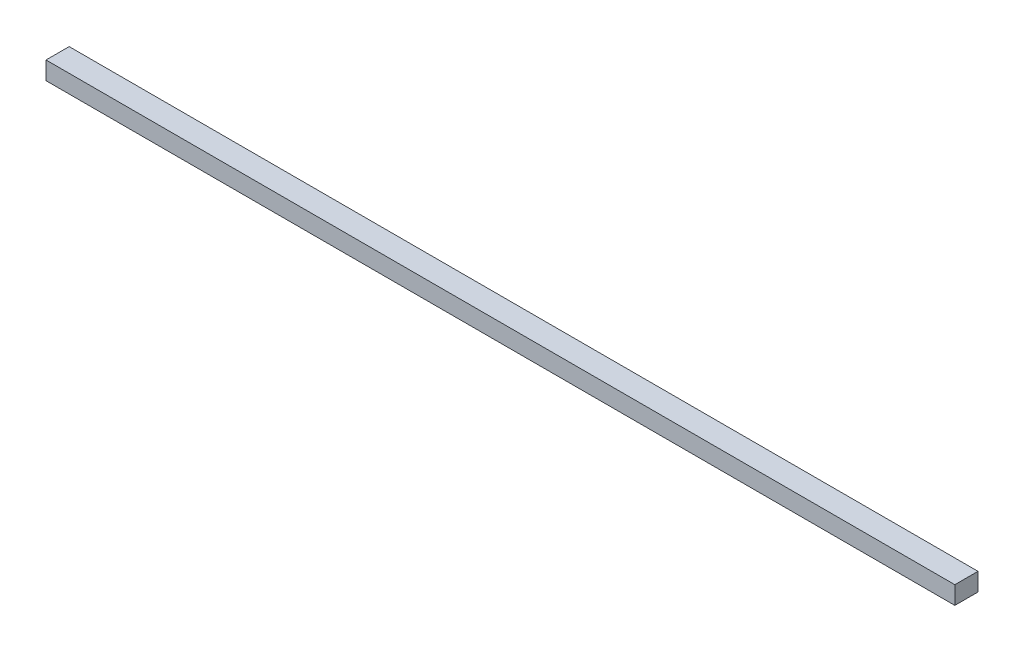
ISO-10303-21;
HEADER;
FILE_DESCRIPTION(('STEP AP214'),'2;1');
FILE_NAME('part.step','',(''),(''),'','','');
FILE_SCHEMA(('AUTOMOTIVE_DESIGN { 1 0 10303 214 1 1 1 1 }'));
ENDSEC;
DATA;
#1=APPLICATION_CONTEXT('core data for automotive mechanical design processes');
#2=APPLICATION_PROTOCOL_DEFINITION('international standard','automotive_design',2000,#1);
#3=PRODUCT_CONTEXT('',#1,'mechanical');
#4=PRODUCT('Part','Part','',(#3));
#5=PRODUCT_RELATED_PRODUCT_CATEGORY('part','',(#4));
#6=PRODUCT_DEFINITION_FORMATION('','',#4);
#7=PRODUCT_DEFINITION_CONTEXT('part definition',#1,'design');
#8=PRODUCT_DEFINITION('design','',#6,#7);
#9=PRODUCT_DEFINITION_SHAPE('','',#8);
#10=(LENGTH_UNIT() NAMED_UNIT(*) SI_UNIT(.MILLI.,.METRE.));
#11=(NAMED_UNIT(*) PLANE_ANGLE_UNIT() SI_UNIT($,.RADIAN.));
#12=(NAMED_UNIT(*) SI_UNIT($,.STERADIAN.) SOLID_ANGLE_UNIT());
#13=UNCERTAINTY_MEASURE_WITH_UNIT(LENGTH_MEASURE(1.E-05),#10,'distance_accuracy_value','');
#14=(GEOMETRIC_REPRESENTATION_CONTEXT(3) GLOBAL_UNCERTAINTY_ASSIGNED_CONTEXT((#13)) GLOBAL_UNIT_ASSIGNED_CONTEXT((#10,
#11,#12)) REPRESENTATION_CONTEXT('',''));
#15=CARTESIAN_POINT('',(0.,0.,0.));
#16=DIRECTION('',(0.,0.,1.));
#17=DIRECTION('',(1.,0.,0.));
#18=AXIS2_PLACEMENT_3D('',#15,#16,#17);
#19=CARTESIAN_POINT('',(321.46875,12.7,8.1915));
#20=DIRECTION('',(-1.,0.,0.));
#21=DIRECTION('',(0.,0.,1.));
#22=AXIS2_PLACEMENT_3D('',#19,#20,#21);
#23=PLANE('',#22);
#24=DIRECTION('',(0.,0.,-1.));
#25=VECTOR('',#24,1.);
#26=CARTESIAN_POINT('',(321.46875,0.,8.1915));
#27=LINE('',#26,#25);
#28=CARTESIAN_POINT('',(321.46875,0.,8.1915));
#29=VERTEX_POINT('',#28);
#30=CARTESIAN_POINT('',(321.46875,0.,-8.1915));
#31=VERTEX_POINT('',#30);
#32=EDGE_CURVE('E96',#29,#31,#27,.T.);
#33=ORIENTED_EDGE('',*,*,#32,.T.);
#34=DIRECTION('',(0.,-1.,0.));
#35=VECTOR('',#34,1.);
#36=CARTESIAN_POINT('',(321.46875,12.7,-8.1915));
#37=LINE('',#36,#35);
#38=CARTESIAN_POINT('',(321.46875,12.7,-8.1915));
#39=VERTEX_POINT('',#38);
#40=EDGE_CURVE('E11',#39,#31,#37,.T.);
#41=ORIENTED_EDGE('',*,*,#40,.F.);
#42=DIRECTION('',(0.,0.,-1.));
#43=VECTOR('',#42,1.);
#44=CARTESIAN_POINT('',(321.46875,12.7,8.1915));
#45=LINE('',#44,#43);
#46=CARTESIAN_POINT('',(321.46875,12.7,8.1915));
#47=VERTEX_POINT('',#46);
#48=EDGE_CURVE('E84',#47,#39,#45,.T.);
#49=ORIENTED_EDGE('',*,*,#48,.F.);
#50=DIRECTION('',(0.,-1.,0.));
#51=VECTOR('',#50,1.);
#52=CARTESIAN_POINT('',(321.46875,12.7,8.1915));
#53=LINE('',#52,#51);
#54=EDGE_CURVE('E92',#47,#29,#53,.T.);
#55=ORIENTED_EDGE('',*,*,#54,.T.);
#56=EDGE_LOOP('',(#33,#41,#49,#55));
#57=FACE_BOUND('',#56,.T.);
#58=ADVANCED_FACE('F33',(#57),#23,.F.);
#59=CARTESIAN_POINT('',(-321.46875,12.7,-8.1915));
#60=DIRECTION('',(0.,0.,1.));
#61=DIRECTION('',(1.,0.,0.));
#62=AXIS2_PLACEMENT_3D('',#59,#60,#61);
#63=PLANE('',#62);
#64=DIRECTION('',(-1.,0.,0.));
#65=VECTOR('',#64,1.);
#66=CARTESIAN_POINT('',(-321.46875,0.,-8.1915));
#67=LINE('',#66,#65);
#68=CARTESIAN_POINT('',(-321.46875,0.,-8.1915));
#69=VERTEX_POINT('',#68);
#70=EDGE_CURVE('E88',#31,#69,#67,.T.);
#71=ORIENTED_EDGE('',*,*,#70,.T.);
#72=DIRECTION('',(0.,-1.,0.));
#73=VECTOR('',#72,1.);
#74=CARTESIAN_POINT('',(-321.46875,12.7,-8.1915));
#75=LINE('',#74,#73);
#76=CARTESIAN_POINT('',(-321.46875,12.7,-8.1915));
#77=VERTEX_POINT('',#76);
#78=EDGE_CURVE('E41',#77,#69,#75,.T.);
#79=ORIENTED_EDGE('',*,*,#78,.F.);
#80=DIRECTION('',(-1.,0.,0.));
#81=VECTOR('',#80,1.);
#82=CARTESIAN_POINT('',(-321.46875,12.7,-8.1915));
#83=LINE('',#82,#81);
#84=EDGE_CURVE('E79',#39,#77,#83,.T.);
#85=ORIENTED_EDGE('',*,*,#84,.F.);
#86=ORIENTED_EDGE('',*,*,#40,.T.);
#87=EDGE_LOOP('',(#71,#79,#85,#86));
#88=FACE_BOUND('',#87,.T.);
#89=ADVANCED_FACE('F87',(#88),#63,.F.);
#90=CARTESIAN_POINT('',(-321.46875,12.7,8.1915));
#91=DIRECTION('',(1.,0.,0.));
#92=DIRECTION('',(0.,0.,-1.));
#93=AXIS2_PLACEMENT_3D('',#90,#91,#92);
#94=PLANE('',#93);
#95=DIRECTION('',(0.,0.,1.));
#96=VECTOR('',#95,1.);
#97=CARTESIAN_POINT('',(-321.46875,0.,8.1915));
#98=LINE('',#97,#96);
#99=CARTESIAN_POINT('',(-321.46875,0.,8.1915));
#100=VERTEX_POINT('',#99);
#101=EDGE_CURVE('E66',#69,#100,#98,.T.);
#102=ORIENTED_EDGE('',*,*,#101,.T.);
#103=DIRECTION('',(0.,-1.,0.));
#104=VECTOR('',#103,1.);
#105=CARTESIAN_POINT('',(-321.46875,12.7,8.1915));
#106=LINE('',#105,#104);
#107=CARTESIAN_POINT('',(-321.46875,12.7,8.1915));
#108=VERTEX_POINT('',#107);
#109=EDGE_CURVE('E89',#108,#100,#106,.T.);
#110=ORIENTED_EDGE('',*,*,#109,.F.);
#111=DIRECTION('',(0.,0.,1.));
#112=VECTOR('',#111,1.);
#113=CARTESIAN_POINT('',(-321.46875,12.7,8.1915));
#114=LINE('',#113,#112);
#115=EDGE_CURVE('E82',#77,#108,#114,.T.);
#116=ORIENTED_EDGE('',*,*,#115,.F.);
#117=ORIENTED_EDGE('',*,*,#78,.T.);
#118=EDGE_LOOP('',(#102,#110,#116,#117));
#119=FACE_BOUND('',#118,.T.);
#120=ADVANCED_FACE('F90',(#119),#94,.F.);
#121=CARTESIAN_POINT('',(-321.46875,12.7,8.1915));
#122=DIRECTION('',(0.,0.,-1.));
#123=DIRECTION('',(-1.,0.,0.));
#124=AXIS2_PLACEMENT_3D('',#121,#122,#123);
#125=PLANE('',#124);
#126=DIRECTION('',(1.,0.,0.));
#127=VECTOR('',#126,1.);
#128=CARTESIAN_POINT('',(-321.46875,0.,8.1915));
#129=LINE('',#128,#127);
#130=EDGE_CURVE('E72',#100,#29,#129,.T.);
#131=ORIENTED_EDGE('',*,*,#130,.T.);
#132=ORIENTED_EDGE('',*,*,#54,.F.);
#133=DIRECTION('',(1.,0.,0.));
#134=VECTOR('',#133,1.);
#135=CARTESIAN_POINT('',(-321.46875,12.7,8.1915));
#136=LINE('',#135,#134);
#137=EDGE_CURVE('E49',#108,#47,#136,.T.);
#138=ORIENTED_EDGE('',*,*,#137,.F.);
#139=ORIENTED_EDGE('',*,*,#109,.T.);
#140=EDGE_LOOP('',(#131,#132,#138,#139));
#141=FACE_BOUND('',#140,.T.);
#142=ADVANCED_FACE('F103',(#141),#125,.F.);
#143=CARTESIAN_POINT('',(0.,12.7,0.));
#144=DIRECTION('',(0.,-1.,0.));
#145=DIRECTION('',(0.,0.,-1.));
#146=AXIS2_PLACEMENT_3D('',#143,#144,#145);
#147=PLANE('',#146);
#148=ORIENTED_EDGE('',*,*,#48,.T.);
#149=ORIENTED_EDGE('',*,*,#84,.T.);
#150=ORIENTED_EDGE('',*,*,#115,.T.);
#151=ORIENTED_EDGE('',*,*,#137,.T.);
#152=EDGE_LOOP('',(#148,#149,#150,#151));
#153=FACE_BOUND('',#152,.T.);
#154=ADVANCED_FACE('F80',(#153),#147,.F.);
#155=CARTESIAN_POINT('',(0.,0.,0.));
#156=DIRECTION('',(0.,-1.,0.));
#157=DIRECTION('',(0.,0.,-1.));
#158=AXIS2_PLACEMENT_3D('',#155,#156,#157);
#159=PLANE('',#158);
#160=ORIENTED_EDGE('',*,*,#32,.F.);
#161=ORIENTED_EDGE('',*,*,#130,.F.);
#162=ORIENTED_EDGE('',*,*,#101,.F.);
#163=ORIENTED_EDGE('',*,*,#70,.F.);
#164=EDGE_LOOP('',(#160,#161,#162,#163));
#165=FACE_BOUND('',#164,.T.);
#166=ADVANCED_FACE('F106',(#165),#159,.T.);
#167=CLOSED_SHELL('',(#58,#89,#120,#142,#154,#166));
#168=MANIFOLD_SOLID_BREP('B2',#167);
#169=ADVANCED_BREP_SHAPE_REPRESENTATION('',(#18,#168),#14);
#170=SHAPE_DEFINITION_REPRESENTATION(#9,#169);
ENDSEC;
END-ISO-10303-21;
